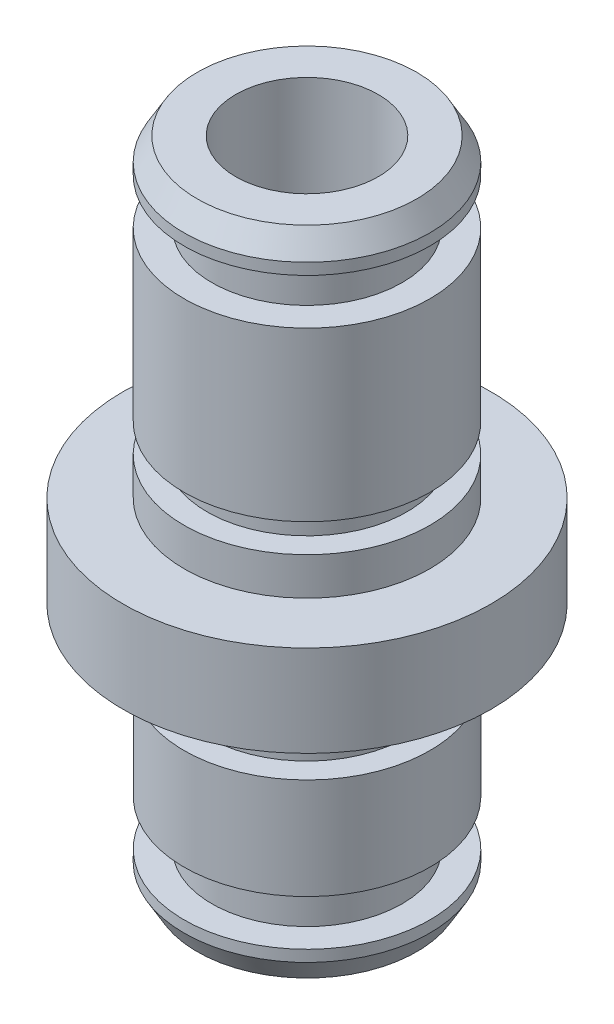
ISO-10303-21;
HEADER;
FILE_DESCRIPTION(('STEP AP214'),'2;1');
FILE_NAME('part.step','',(''),(''),'','','');
FILE_SCHEMA(('AUTOMOTIVE_DESIGN { 1 0 10303 214 1 1 1 1 }'));
ENDSEC;
DATA;
#1=APPLICATION_CONTEXT('core data for automotive mechanical design processes');
#2=APPLICATION_PROTOCOL_DEFINITION('international standard','automotive_design',2000,#1);
#3=PRODUCT_CONTEXT('',#1,'mechanical');
#4=PRODUCT('Part','Part','',(#3));
#5=PRODUCT_RELATED_PRODUCT_CATEGORY('part','',(#4));
#6=PRODUCT_DEFINITION_FORMATION('','',#4);
#7=PRODUCT_DEFINITION_CONTEXT('part definition',#1,'design');
#8=PRODUCT_DEFINITION('design','',#6,#7);
#9=PRODUCT_DEFINITION_SHAPE('','',#8);
#10=(LENGTH_UNIT() NAMED_UNIT(*) SI_UNIT(.MILLI.,.METRE.));
#11=(NAMED_UNIT(*) PLANE_ANGLE_UNIT() SI_UNIT($,.RADIAN.));
#12=(NAMED_UNIT(*) SI_UNIT($,.STERADIAN.) SOLID_ANGLE_UNIT());
#13=UNCERTAINTY_MEASURE_WITH_UNIT(LENGTH_MEASURE(1.E-05),#10,'distance_accuracy_value','');
#14=(GEOMETRIC_REPRESENTATION_CONTEXT(3) GLOBAL_UNCERTAINTY_ASSIGNED_CONTEXT((#13)) GLOBAL_UNIT_ASSIGNED_CONTEXT((#10,
#11,#12)) REPRESENTATION_CONTEXT('',''));
#15=CARTESIAN_POINT('',(0.,0.,0.));
#16=DIRECTION('',(0.,0.,1.));
#17=DIRECTION('',(1.,0.,0.));
#18=AXIS2_PLACEMENT_3D('',#15,#16,#17);
#19=CARTESIAN_POINT('',(0.,4.064,0.));
#20=DIRECTION('',(0.,-1.,0.));
#21=DIRECTION('',(1.,0.,0.));
#22=AXIS2_PLACEMENT_3D('',#19,#20,#21);
#23=CYLINDRICAL_SURFACE('',#22,8.19149999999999);
#24=CARTESIAN_POINT('',(0.,4.064,0.));
#25=DIRECTION('',(0.,-1.,0.));
#26=DIRECTION('',(1.,0.,0.));
#27=AXIS2_PLACEMENT_3D('',#24,#25,#26);
#28=CIRCLE('',#27,8.19149999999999);
#29=CARTESIAN_POINT('',(8.19149999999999,4.064,0.));
#30=VERTEX_POINT('',#29);
#31=EDGE_CURVE('E18',#30,#30,#28,.F.);
#32=ORIENTED_EDGE('',*,*,#31,.F.);
#33=EDGE_LOOP('',(#32));
#34=FACE_BOUND('',#33,.T.);
#35=CARTESIAN_POINT('',(0.,0.,0.));
#36=DIRECTION('',(0.,-1.,0.));
#37=DIRECTION('',(1.,0.,0.));
#38=AXIS2_PLACEMENT_3D('',#35,#36,#37);
#39=CIRCLE('',#38,8.19149999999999);
#40=CARTESIAN_POINT('',(8.19149999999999,0.,0.));
#41=VERTEX_POINT('',#40);
#42=EDGE_CURVE('E92',#41,#41,#39,.F.);
#43=ORIENTED_EDGE('',*,*,#42,.T.);
#44=EDGE_LOOP('',(#43));
#45=FACE_BOUND('',#44,.T.);
#46=ADVANCED_FACE('F15',(#34,#45),#23,.T.);
#47=CARTESIAN_POINT('',(0.,4.064,0.));
#48=DIRECTION('',(0.,1.,0.));
#49=DIRECTION('',(-1.,0.,0.));
#50=AXIS2_PLACEMENT_3D('',#47,#48,#49);
#51=PLANE('',#50);
#52=CARTESIAN_POINT('',(0.,4.064,0.));
#53=DIRECTION('',(0.,-1.,0.));
#54=DIRECTION('',(1.,0.,0.));
#55=AXIS2_PLACEMENT_3D('',#52,#53,#54);
#56=CIRCLE('',#55,5.47369999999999);
#57=CARTESIAN_POINT('',(5.47369999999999,4.064,0.));
#58=VERTEX_POINT('',#57);
#59=EDGE_CURVE('E90',#58,#58,#56,.F.);
#60=ORIENTED_EDGE('',*,*,#59,.F.);
#61=EDGE_LOOP('',(#60));
#62=FACE_BOUND('',#61,.T.);
#63=ORIENTED_EDGE('',*,*,#31,.T.);
#64=EDGE_LOOP('',(#63));
#65=FACE_BOUND('',#64,.T.);
#66=ADVANCED_FACE('F99',(#62,#65),#51,.T.);
#67=CARTESIAN_POINT('',(0.,0.,0.));
#68=DIRECTION('',(0.,1.,0.));
#69=DIRECTION('',(-1.,0.,0.));
#70=AXIS2_PLACEMENT_3D('',#67,#68,#69);
#71=PLANE('',#70);
#72=CARTESIAN_POINT('',(0.,0.,0.));
#73=DIRECTION('',(0.,1.,0.));
#74=DIRECTION('',(-1.,0.,0.));
#75=AXIS2_PLACEMENT_3D('',#72,#73,#74);
#76=CIRCLE('',#75,5.47369999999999);
#77=CARTESIAN_POINT('',(-5.47369999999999,0.,0.));
#78=VERTEX_POINT('',#77);
#79=EDGE_CURVE('E87',#78,#78,#76,.F.);
#80=ORIENTED_EDGE('',*,*,#79,.F.);
#81=EDGE_LOOP('',(#80));
#82=FACE_BOUND('',#81,.T.);
#83=ORIENTED_EDGE('',*,*,#42,.F.);
#84=EDGE_LOOP('',(#83));
#85=FACE_BOUND('',#84,.T.);
#86=ADVANCED_FACE('F106',(#82,#85),#71,.F.);
#87=CARTESIAN_POINT('',(0.,18.034,0.));
#88=DIRECTION('',(0.,-1.,0.));
#89=DIRECTION('',(1.,0.,0.));
#90=AXIS2_PLACEMENT_3D('',#87,#88,#89);
#91=CYLINDRICAL_SURFACE('',#90,5.47369999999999);
#92=ORIENTED_EDGE('',*,*,#59,.T.);
#93=EDGE_LOOP('',(#92));
#94=FACE_BOUND('',#93,.T.);
#95=CARTESIAN_POINT('',(0.,5.74040000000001,0.));
#96=DIRECTION('',(0.,-1.,0.));
#97=DIRECTION('',(1.,0.,0.));
#98=AXIS2_PLACEMENT_3D('',#95,#96,#97);
#99=CIRCLE('',#98,5.47369999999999);
#100=CARTESIAN_POINT('',(5.47369999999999,5.74040000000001,0.));
#101=VERTEX_POINT('',#100);
#102=EDGE_CURVE('E84',#101,#101,#99,.F.);
#103=ORIENTED_EDGE('',*,*,#102,.F.);
#104=EDGE_LOOP('',(#103));
#105=FACE_BOUND('',#104,.T.);
#106=ADVANCED_FACE('F200',(#94,#105),#91,.T.);
#107=CARTESIAN_POINT('',(0.,-11.,0.));
#108=DIRECTION('',(0.,1.,0.));
#109=DIRECTION('',(-1.,0.,0.));
#110=AXIS2_PLACEMENT_3D('',#107,#108,#109);
#111=CYLINDRICAL_SURFACE('',#110,5.47369999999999);
#112=CARTESIAN_POINT('',(0.,-1.67639999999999,0.));
#113=DIRECTION('',(0.,1.,0.));
#114=DIRECTION('',(-1.,0.,0.));
#115=AXIS2_PLACEMENT_3D('',#112,#113,#114);
#116=CIRCLE('',#115,5.47369999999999);
#117=CARTESIAN_POINT('',(-5.47369999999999,-1.6764,0.));
#118=VERTEX_POINT('',#117);
#119=EDGE_CURVE('E81',#118,#118,#116,.F.);
#120=ORIENTED_EDGE('',*,*,#119,.F.);
#121=EDGE_LOOP('',(#120));
#122=FACE_BOUND('',#121,.T.);
#123=ORIENTED_EDGE('',*,*,#79,.T.);
#124=EDGE_LOOP('',(#123));
#125=FACE_BOUND('',#124,.T.);
#126=ADVANCED_FACE('F196',(#122,#125),#111,.T.);
#127=CARTESIAN_POINT('',(0.,5.74040000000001,-5.47369999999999));
#128=DIRECTION('',(0.,1.,0.));
#129=DIRECTION('',(-1.,0.,0.));
#130=AXIS2_PLACEMENT_3D('',#127,#128,#129);
#131=PLANE('',#130);
#132=CARTESIAN_POINT('',(0.,5.74040000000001,0.));
#133=DIRECTION('',(0.,1.,0.));
#134=DIRECTION('',(-1.,0.,0.));
#135=AXIS2_PLACEMENT_3D('',#132,#133,#134);
#136=CIRCLE('',#135,4.445);
#137=CARTESIAN_POINT('',(-4.445,5.74040000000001,0.));
#138=VERTEX_POINT('',#137);
#139=EDGE_CURVE('E78',#138,#138,#136,.T.);
#140=ORIENTED_EDGE('',*,*,#139,.F.);
#141=EDGE_LOOP('',(#140));
#142=FACE_BOUND('',#141,.T.);
#143=ORIENTED_EDGE('',*,*,#102,.T.);
#144=EDGE_LOOP('',(#143));
#145=FACE_BOUND('',#144,.T.);
#146=ADVANCED_FACE('F192',(#142,#145),#131,.T.);
#147=CARTESIAN_POINT('',(0.,-1.67639999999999,-5.47369999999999));
#148=DIRECTION('',(0.,-1.,0.));
#149=DIRECTION('',(1.,0.,0.));
#150=AXIS2_PLACEMENT_3D('',#147,#148,#149);
#151=PLANE('',#150);
#152=ORIENTED_EDGE('',*,*,#119,.T.);
#153=EDGE_LOOP('',(#152));
#154=FACE_BOUND('',#153,.T.);
#155=CARTESIAN_POINT('',(0.,-1.67639999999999,0.));
#156=DIRECTION('',(0.,1.,0.));
#157=DIRECTION('',(-1.,0.,0.));
#158=AXIS2_PLACEMENT_3D('',#155,#156,#157);
#159=CIRCLE('',#158,4.445);
#160=CARTESIAN_POINT('',(-4.445,-1.6764,0.));
#161=VERTEX_POINT('',#160);
#162=EDGE_CURVE('E75',#161,#161,#159,.F.);
#163=ORIENTED_EDGE('',*,*,#162,.F.);
#164=EDGE_LOOP('',(#163));
#165=FACE_BOUND('',#164,.T.);
#166=ADVANCED_FACE('F188',(#154,#165),#151,.T.);
#167=CARTESIAN_POINT('',(0.,18.034,0.));
#168=DIRECTION('',(0.,1.,0.));
#169=DIRECTION('',(-1.,0.,0.));
#170=AXIS2_PLACEMENT_3D('',#167,#168,#169);
#171=CYLINDRICAL_SURFACE('',#170,4.445);
#172=ORIENTED_EDGE('',*,*,#139,.T.);
#173=EDGE_LOOP('',(#172));
#174=FACE_BOUND('',#173,.T.);
#175=CARTESIAN_POINT('',(0.,7.0104,0.));
#176=DIRECTION('',(0.,1.,0.));
#177=DIRECTION('',(-1.,0.,0.));
#178=AXIS2_PLACEMENT_3D('',#175,#176,#177);
#179=CIRCLE('',#178,4.445);
#180=CARTESIAN_POINT('',(-4.445,7.0104,0.));
#181=VERTEX_POINT('',#180);
#182=EDGE_CURVE('E72',#181,#181,#179,.T.);
#183=ORIENTED_EDGE('',*,*,#182,.F.);
#184=EDGE_LOOP('',(#183));
#185=FACE_BOUND('',#184,.T.);
#186=ADVANCED_FACE('F184',(#174,#185),#171,.T.);
#187=CARTESIAN_POINT('',(0.,18.034,0.));
#188=DIRECTION('',(0.,1.,0.));
#189=DIRECTION('',(-1.,0.,0.));
#190=AXIS2_PLACEMENT_3D('',#187,#188,#189);
#191=CYLINDRICAL_SURFACE('',#190,4.445);
#192=CARTESIAN_POINT('',(0.,-2.9464,0.));
#193=DIRECTION('',(0.,1.,0.));
#194=DIRECTION('',(-1.,0.,0.));
#195=AXIS2_PLACEMENT_3D('',#192,#193,#194);
#196=CIRCLE('',#195,4.445);
#197=CARTESIAN_POINT('',(-4.445,-2.9464,0.));
#198=VERTEX_POINT('',#197);
#199=EDGE_CURVE('E69',#198,#198,#196,.F.);
#200=ORIENTED_EDGE('',*,*,#199,.F.);
#201=EDGE_LOOP('',(#200));
#202=FACE_BOUND('',#201,.T.);
#203=ORIENTED_EDGE('',*,*,#162,.T.);
#204=EDGE_LOOP('',(#203));
#205=FACE_BOUND('',#204,.T.);
#206=ADVANCED_FACE('F180',(#202,#205),#191,.T.);
#207=CARTESIAN_POINT('',(0.,7.0104,-5.47369999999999));
#208=DIRECTION('',(0.,-1.,0.));
#209=DIRECTION('',(1.,0.,0.));
#210=AXIS2_PLACEMENT_3D('',#207,#208,#209);
#211=PLANE('',#210);
#212=CARTESIAN_POINT('',(0.,7.0104,0.));
#213=DIRECTION('',(0.,-1.,0.));
#214=DIRECTION('',(1.,0.,0.));
#215=AXIS2_PLACEMENT_3D('',#212,#213,#214);
#216=CIRCLE('',#215,5.47369999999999);
#217=CARTESIAN_POINT('',(5.47369999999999,7.0104,0.));
#218=VERTEX_POINT('',#217);
#219=EDGE_CURVE('E66',#218,#218,#216,.F.);
#220=ORIENTED_EDGE('',*,*,#219,.F.);
#221=EDGE_LOOP('',(#220));
#222=FACE_BOUND('',#221,.T.);
#223=ORIENTED_EDGE('',*,*,#182,.T.);
#224=EDGE_LOOP('',(#223));
#225=FACE_BOUND('',#224,.T.);
#226=ADVANCED_FACE('F176',(#222,#225),#211,.T.);
#227=CARTESIAN_POINT('',(0.,-2.9464,-5.47369999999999));
#228=DIRECTION('',(0.,1.,0.));
#229=DIRECTION('',(-1.,0.,0.));
#230=AXIS2_PLACEMENT_3D('',#227,#228,#229);
#231=PLANE('',#230);
#232=ORIENTED_EDGE('',*,*,#199,.T.);
#233=EDGE_LOOP('',(#232));
#234=FACE_BOUND('',#233,.T.);
#235=CARTESIAN_POINT('',(0.,-2.9464,0.));
#236=DIRECTION('',(0.,1.,0.));
#237=DIRECTION('',(-1.,0.,0.));
#238=AXIS2_PLACEMENT_3D('',#235,#236,#237);
#239=CIRCLE('',#238,5.47369999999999);
#240=CARTESIAN_POINT('',(-5.47369999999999,-2.9464,0.));
#241=VERTEX_POINT('',#240);
#242=EDGE_CURVE('E63',#241,#241,#239,.F.);
#243=ORIENTED_EDGE('',*,*,#242,.F.);
#244=EDGE_LOOP('',(#243));
#245=FACE_BOUND('',#244,.T.);
#246=ADVANCED_FACE('F172',(#234,#245),#231,.T.);
#247=CARTESIAN_POINT('',(0.,18.034,0.));
#248=DIRECTION('',(0.,-1.,0.));
#249=DIRECTION('',(1.,0.,0.));
#250=AXIS2_PLACEMENT_3D('',#247,#248,#249);
#251=CYLINDRICAL_SURFACE('',#250,5.47369999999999);
#252=ORIENTED_EDGE('',*,*,#219,.T.);
#253=EDGE_LOOP('',(#252));
#254=FACE_BOUND('',#253,.T.);
#255=CARTESIAN_POINT('',(0.,14.478,0.));
#256=DIRECTION('',(0.,-1.,0.));
#257=DIRECTION('',(1.,0.,0.));
#258=AXIS2_PLACEMENT_3D('',#255,#256,#257);
#259=CIRCLE('',#258,5.47369999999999);
#260=CARTESIAN_POINT('',(5.47369999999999,14.478,0.));
#261=VERTEX_POINT('',#260);
#262=EDGE_CURVE('E60',#261,#261,#259,.F.);
#263=ORIENTED_EDGE('',*,*,#262,.F.);
#264=EDGE_LOOP('',(#263));
#265=FACE_BOUND('',#264,.T.);
#266=ADVANCED_FACE('F168',(#254,#265),#251,.T.);
#267=CARTESIAN_POINT('',(0.,-11.,0.));
#268=DIRECTION('',(0.,1.,0.));
#269=DIRECTION('',(-1.,0.,0.));
#270=AXIS2_PLACEMENT_3D('',#267,#268,#269);
#271=CYLINDRICAL_SURFACE('',#270,5.47369999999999);
#272=CARTESIAN_POINT('',(0.,-7.44400000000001,0.));
#273=DIRECTION('',(0.,1.,0.));
#274=DIRECTION('',(-1.,0.,0.));
#275=AXIS2_PLACEMENT_3D('',#272,#273,#274);
#276=CIRCLE('',#275,5.47369999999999);
#277=CARTESIAN_POINT('',(-5.47369999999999,-7.44400000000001,0.));
#278=VERTEX_POINT('',#277);
#279=EDGE_CURVE('E57',#278,#278,#276,.F.);
#280=ORIENTED_EDGE('',*,*,#279,.F.);
#281=EDGE_LOOP('',(#280));
#282=FACE_BOUND('',#281,.T.);
#283=ORIENTED_EDGE('',*,*,#242,.T.);
#284=EDGE_LOOP('',(#283));
#285=FACE_BOUND('',#284,.T.);
#286=ADVANCED_FACE('F164',(#282,#285),#271,.T.);
#287=CARTESIAN_POINT('',(0.,14.478,-5.47369999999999));
#288=DIRECTION('',(0.,1.,0.));
#289=DIRECTION('',(-1.,0.,0.));
#290=AXIS2_PLACEMENT_3D('',#287,#288,#289);
#291=PLANE('',#290);
#292=CARTESIAN_POINT('',(0.,14.478,0.));
#293=DIRECTION('',(0.,1.,0.));
#294=DIRECTION('',(-1.,0.,0.));
#295=AXIS2_PLACEMENT_3D('',#292,#293,#294);
#296=CIRCLE('',#295,4.23545);
#297=CARTESIAN_POINT('',(-4.23545,14.478,0.));
#298=VERTEX_POINT('',#297);
#299=EDGE_CURVE('E54',#298,#298,#296,.T.);
#300=ORIENTED_EDGE('',*,*,#299,.F.);
#301=EDGE_LOOP('',(#300));
#302=FACE_BOUND('',#301,.T.);
#303=ORIENTED_EDGE('',*,*,#262,.T.);
#304=EDGE_LOOP('',(#303));
#305=FACE_BOUND('',#304,.T.);
#306=ADVANCED_FACE('F160',(#302,#305),#291,.T.);
#307=CARTESIAN_POINT('',(0.,-7.44400000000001,-5.47369999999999));
#308=DIRECTION('',(0.,-1.,0.));
#309=DIRECTION('',(1.,0.,0.));
#310=AXIS2_PLACEMENT_3D('',#307,#308,#309);
#311=PLANE('',#310);
#312=ORIENTED_EDGE('',*,*,#279,.T.);
#313=EDGE_LOOP('',(#312));
#314=FACE_BOUND('',#313,.T.);
#315=CARTESIAN_POINT('',(0.,-7.44400000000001,0.));
#316=DIRECTION('',(0.,1.,0.));
#317=DIRECTION('',(-1.,0.,0.));
#318=AXIS2_PLACEMENT_3D('',#315,#316,#317);
#319=CIRCLE('',#318,4.23545);
#320=CARTESIAN_POINT('',(-4.23545,-7.44400000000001,0.));
#321=VERTEX_POINT('',#320);
#322=EDGE_CURVE('E51',#321,#321,#319,.F.);
#323=ORIENTED_EDGE('',*,*,#322,.F.);
#324=EDGE_LOOP('',(#323));
#325=FACE_BOUND('',#324,.T.);
#326=ADVANCED_FACE('F156',(#314,#325),#311,.T.);
#327=CARTESIAN_POINT('',(0.,18.034,0.));
#328=DIRECTION('',(0.,1.,0.));
#329=DIRECTION('',(-1.,0.,0.));
#330=AXIS2_PLACEMENT_3D('',#327,#328,#329);
#331=CYLINDRICAL_SURFACE('',#330,4.23545);
#332=ORIENTED_EDGE('',*,*,#299,.T.);
#333=EDGE_LOOP('',(#332));
#334=FACE_BOUND('',#333,.T.);
#335=CARTESIAN_POINT('',(0.,16.51,0.));
#336=DIRECTION('',(0.,1.,0.));
#337=DIRECTION('',(-1.,0.,0.));
#338=AXIS2_PLACEMENT_3D('',#335,#336,#337);
#339=CIRCLE('',#338,4.23545);
#340=CARTESIAN_POINT('',(-4.23545,16.51,0.));
#341=VERTEX_POINT('',#340);
#342=EDGE_CURVE('E48',#341,#341,#339,.T.);
#343=ORIENTED_EDGE('',*,*,#342,.F.);
#344=EDGE_LOOP('',(#343));
#345=FACE_BOUND('',#344,.T.);
#346=ADVANCED_FACE('F152',(#334,#345),#331,.T.);
#347=CARTESIAN_POINT('',(0.,18.034,0.));
#348=DIRECTION('',(0.,1.,0.));
#349=DIRECTION('',(-1.,0.,0.));
#350=AXIS2_PLACEMENT_3D('',#347,#348,#349);
#351=CYLINDRICAL_SURFACE('',#350,4.23545);
#352=CARTESIAN_POINT('',(0.,-9.476,0.));
#353=DIRECTION('',(0.,1.,0.));
#354=DIRECTION('',(-1.,0.,0.));
#355=AXIS2_PLACEMENT_3D('',#352,#353,#354);
#356=CIRCLE('',#355,4.23545);
#357=CARTESIAN_POINT('',(-4.23545,-9.476,0.));
#358=VERTEX_POINT('',#357);
#359=EDGE_CURVE('E45',#358,#358,#356,.F.);
#360=ORIENTED_EDGE('',*,*,#359,.F.);
#361=EDGE_LOOP('',(#360));
#362=FACE_BOUND('',#361,.T.);
#363=ORIENTED_EDGE('',*,*,#322,.T.);
#364=EDGE_LOOP('',(#363));
#365=FACE_BOUND('',#364,.T.);
#366=ADVANCED_FACE('F148',(#362,#365),#351,.T.);
#367=CARTESIAN_POINT('',(0.,16.51,-5.47369999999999));
#368=DIRECTION('',(0.,-1.,0.));
#369=DIRECTION('',(1.,0.,0.));
#370=AXIS2_PLACEMENT_3D('',#367,#368,#369);
#371=PLANE('',#370);
#372=CARTESIAN_POINT('',(0.,16.51,0.));
#373=DIRECTION('',(0.,-1.,0.));
#374=DIRECTION('',(1.,0.,0.));
#375=AXIS2_PLACEMENT_3D('',#372,#373,#374);
#376=CIRCLE('',#375,5.47369999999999);
#377=CARTESIAN_POINT('',(5.47369999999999,16.51,0.));
#378=VERTEX_POINT('',#377);
#379=EDGE_CURVE('E42',#378,#378,#376,.F.);
#380=ORIENTED_EDGE('',*,*,#379,.F.);
#381=EDGE_LOOP('',(#380));
#382=FACE_BOUND('',#381,.T.);
#383=ORIENTED_EDGE('',*,*,#342,.T.);
#384=EDGE_LOOP('',(#383));
#385=FACE_BOUND('',#384,.T.);
#386=ADVANCED_FACE('F144',(#382,#385),#371,.T.);
#387=CARTESIAN_POINT('',(0.,-9.476,-5.47369999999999));
#388=DIRECTION('',(0.,1.,0.));
#389=DIRECTION('',(-1.,0.,0.));
#390=AXIS2_PLACEMENT_3D('',#387,#388,#389);
#391=PLANE('',#390);
#392=ORIENTED_EDGE('',*,*,#359,.T.);
#393=EDGE_LOOP('',(#392));
#394=FACE_BOUND('',#393,.T.);
#395=CARTESIAN_POINT('',(0.,-9.476,0.));
#396=DIRECTION('',(0.,1.,0.));
#397=DIRECTION('',(-1.,0.,0.));
#398=AXIS2_PLACEMENT_3D('',#395,#396,#397);
#399=CIRCLE('',#398,5.47369999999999);
#400=CARTESIAN_POINT('',(-5.47369999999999,-9.476,0.));
#401=VERTEX_POINT('',#400);
#402=EDGE_CURVE('E39',#401,#401,#399,.F.);
#403=ORIENTED_EDGE('',*,*,#402,.F.);
#404=EDGE_LOOP('',(#403));
#405=FACE_BOUND('',#404,.T.);
#406=ADVANCED_FACE('F140',(#394,#405),#391,.T.);
#407=CARTESIAN_POINT('',(0.,18.034,0.));
#408=DIRECTION('',(0.,-1.,0.));
#409=DIRECTION('',(1.,0.,0.));
#410=AXIS2_PLACEMENT_3D('',#407,#408,#409);
#411=CYLINDRICAL_SURFACE('',#410,5.47369999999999);
#412=ORIENTED_EDGE('',*,*,#379,.T.);
#413=EDGE_LOOP('',(#412));
#414=FACE_BOUND('',#413,.T.);
#415=CARTESIAN_POINT('',(0.,17.0179999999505,0.));
#416=DIRECTION('',(0.,-1.,0.));
#417=DIRECTION('',(0.,0.,-1.));
#418=AXIS2_PLACEMENT_3D('',#415,#416,#417);
#419=CIRCLE('',#418,5.47370000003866);
#420=CARTESIAN_POINT('',(0.,17.0179999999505,-5.47370000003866));
#421=VERTEX_POINT('',#420);
#422=EDGE_CURVE('E30',#421,#421,#419,.F.);
#423=ORIENTED_EDGE('',*,*,#422,.F.);
#424=EDGE_LOOP('',(#423));
#425=FACE_BOUND('',#424,.T.);
#426=ADVANCED_FACE('F136',(#414,#425),#411,.T.);
#427=CARTESIAN_POINT('',(0.,-11.,0.));
#428=DIRECTION('',(0.,1.,0.));
#429=DIRECTION('',(-1.,0.,0.));
#430=AXIS2_PLACEMENT_3D('',#427,#428,#429);
#431=CYLINDRICAL_SURFACE('',#430,5.47369999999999);
#432=ORIENTED_EDGE('',*,*,#402,.T.);
#433=EDGE_LOOP('',(#432));
#434=FACE_BOUND('',#433,.T.);
#435=CARTESIAN_POINT('',(0.,-9.9840000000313,0.));
#436=DIRECTION('',(0.,1.,0.));
#437=DIRECTION('',(0.,0.,1.));
#438=AXIS2_PLACEMENT_3D('',#435,#436,#437);
#439=CIRCLE('',#438,5.47369999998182);
#440=CARTESIAN_POINT('',(0.,-9.9840000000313,5.47369999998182));
#441=VERTEX_POINT('',#440);
#442=EDGE_CURVE('E38',#441,#441,#439,.F.);
#443=ORIENTED_EDGE('',*,*,#442,.F.);
#444=EDGE_LOOP('',(#443));
#445=FACE_BOUND('',#444,.T.);
#446=ADVANCED_FACE('F132',(#434,#445),#431,.T.);
#447=CARTESIAN_POINT('',(0.,17.0179999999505,0.));
#448=DIRECTION('',(0.,-1.,0.));
#449=DIRECTION('',(0.,0.,-1.));
#450=AXIS2_PLACEMENT_3D('',#447,#448,#449);
#451=CONICAL_SURFACE('',#450,5.47370000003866,0.523598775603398);
#452=ORIENTED_EDGE('',*,*,#422,.T.);
#453=EDGE_LOOP('',(#452));
#454=FACE_BOUND('',#453,.T.);
#455=CARTESIAN_POINT('',(0.,18.0340000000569,0.));
#456=DIRECTION('',(0.,-1.,0.));
#457=DIRECTION('',(0.,0.,-1.));
#458=AXIS2_PLACEMENT_3D('',#455,#456,#457);
#459=CIRCLE('',#458,4.88711212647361);
#460=CARTESIAN_POINT('',(0.,18.0340000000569,-4.88711212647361));
#461=VERTEX_POINT('',#460);
#462=EDGE_CURVE('E35',#461,#461,#459,.F.);
#463=ORIENTED_EDGE('',*,*,#462,.F.);
#464=EDGE_LOOP('',(#463));
#465=FACE_BOUND('',#464,.T.);
#466=ADVANCED_FACE('F128',(#454,#465),#451,.T.);
#467=CARTESIAN_POINT('',(0.,-9.98400000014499,0.));
#468=DIRECTION('',(0.,1.,0.));
#469=DIRECTION('',(-1.,0.,0.));
#470=AXIS2_PLACEMENT_3D('',#467,#468,#469);
#471=CONICAL_SURFACE('',#470,5.47369999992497,0.523598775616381);
#472=ORIENTED_EDGE('',*,*,#442,.T.);
#473=EDGE_LOOP('',(#472));
#474=FACE_BOUND('',#473,.T.);
#475=CARTESIAN_POINT('',(0.,-10.9999999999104,0.));
#476=DIRECTION('',(0.,1.,0.));
#477=DIRECTION('',(-1.,0.,0.));
#478=AXIS2_PLACEMENT_3D('',#475,#476,#477);
#479=CIRCLE('',#478,4.88711212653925);
#480=CARTESIAN_POINT('',(-4.88711212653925,-10.9999999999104,0.));
#481=VERTEX_POINT('',#480);
#482=EDGE_CURVE('E27',#481,#481,#479,.F.);
#483=ORIENTED_EDGE('',*,*,#482,.F.);
#484=EDGE_LOOP('',(#483));
#485=FACE_BOUND('',#484,.T.);
#486=ADVANCED_FACE('F124',(#474,#485),#471,.T.);
#487=CARTESIAN_POINT('',(0.,18.034,0.));
#488=DIRECTION('',(0.,1.,0.));
#489=DIRECTION('',(-1.,0.,0.));
#490=AXIS2_PLACEMENT_3D('',#487,#488,#489);
#491=PLANE('',#490);
#492=ORIENTED_EDGE('',*,*,#462,.T.);
#493=EDGE_LOOP('',(#492));
#494=FACE_BOUND('',#493,.T.);
#495=CARTESIAN_POINT('',(0.,18.034,0.));
#496=DIRECTION('',(0.,1.,0.));
#497=DIRECTION('',(-1.,0.,0.));
#498=AXIS2_PLACEMENT_3D('',#495,#496,#497);
#499=CIRCLE('',#498,3.175);
#500=CARTESIAN_POINT('',(-3.175,18.034,0.));
#501=VERTEX_POINT('',#500);
#502=EDGE_CURVE('E22',#501,#501,#499,.F.);
#503=ORIENTED_EDGE('',*,*,#502,.T.);
#504=EDGE_LOOP('',(#503));
#505=FACE_BOUND('',#504,.T.);
#506=ADVANCED_FACE('F116',(#494,#505),#491,.T.);
#507=CARTESIAN_POINT('',(0.,-11.,0.));
#508=DIRECTION('',(0.,-1.,0.));
#509=DIRECTION('',(1.,0.,0.));
#510=AXIS2_PLACEMENT_3D('',#507,#508,#509);
#511=PLANE('',#510);
#512=ORIENTED_EDGE('',*,*,#482,.T.);
#513=EDGE_LOOP('',(#512));
#514=FACE_BOUND('',#513,.T.);
#515=CARTESIAN_POINT('',(0.,-11.,0.));
#516=DIRECTION('',(0.,1.,0.));
#517=DIRECTION('',(-1.,0.,0.));
#518=AXIS2_PLACEMENT_3D('',#515,#516,#517);
#519=CIRCLE('',#518,3.175);
#520=CARTESIAN_POINT('',(-3.175,-11.,0.));
#521=VERTEX_POINT('',#520);
#522=EDGE_CURVE('E10',#521,#521,#519,.T.);
#523=ORIENTED_EDGE('',*,*,#522,.T.);
#524=EDGE_LOOP('',(#523));
#525=FACE_BOUND('',#524,.T.);
#526=ADVANCED_FACE('F110',(#514,#525),#511,.T.);
#527=CARTESIAN_POINT('',(0.,-11.001,0.));
#528=DIRECTION('',(0.,1.,0.));
#529=DIRECTION('',(-1.,0.,0.));
#530=AXIS2_PLACEMENT_3D('',#527,#528,#529);
#531=CYLINDRICAL_SURFACE('',#530,3.175);
#532=ORIENTED_EDGE('',*,*,#502,.F.);
#533=EDGE_LOOP('',(#532));
#534=FACE_BOUND('',#533,.T.);
#535=ORIENTED_EDGE('',*,*,#522,.F.);
#536=EDGE_LOOP('',(#535));
#537=FACE_BOUND('',#536,.T.);
#538=ADVANCED_FACE('F108',(#534,#537),#531,.F.);
#539=CLOSED_SHELL('',(#46,#66,#86,#106,#126,#146,#166,#186,#206,#226,#246,#266,#286,#306,#326,
#346,#366,#386,#406,#426,#446,#466,#486,#506,#526,#538));
#540=MANIFOLD_SOLID_BREP('B1',#539);
#541=ADVANCED_BREP_SHAPE_REPRESENTATION('',(#18,#540),#14);
#542=SHAPE_DEFINITION_REPRESENTATION(#9,#541);
ENDSEC;
END-ISO-10303-21;
